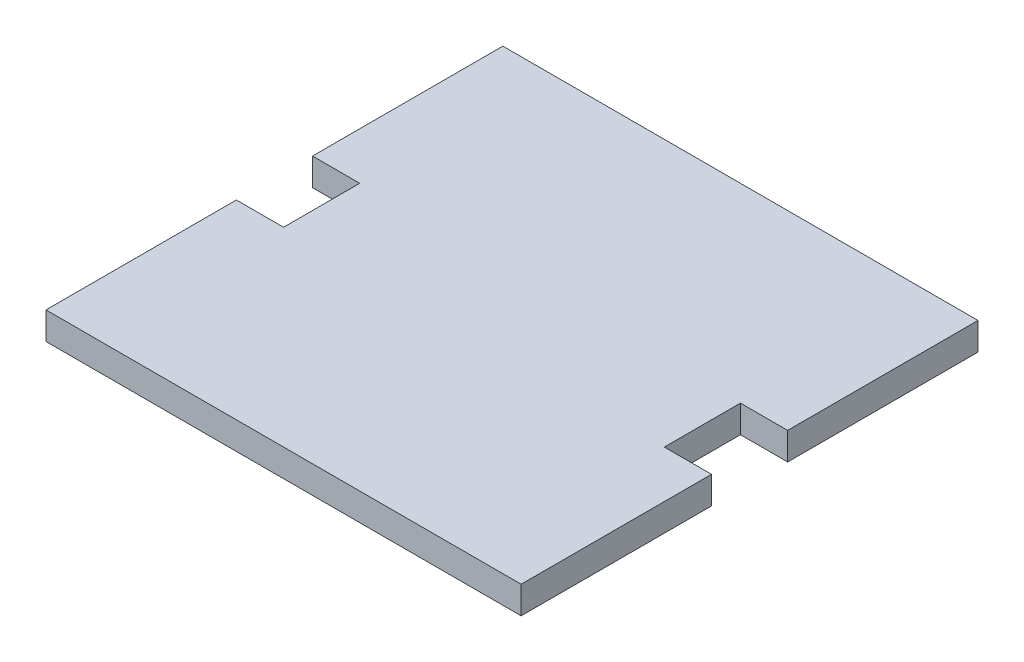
from build123d import *

# Parameters (mm, degrees)
EXTRUDE1_DEPTH = 18


with BuildPart() as part:
    # Sketch1 → Extrude1 (new body)
    with BuildSketch(Plane(origin=(0, 0, 0), x_dir=(1, 0, 0), z_dir=(0, 1, 0))):
        Polygon((-156, 150), (156, 150), (156, 25), (125, 25), (125, -25), (156, -25), (156, -150), (-156, -150), (-156, -25), (-125, -25), (-125, 25), (-156, 25), align=None)
    extrude(amount=EXTRUDE1_DEPTH)


solid = part.part
